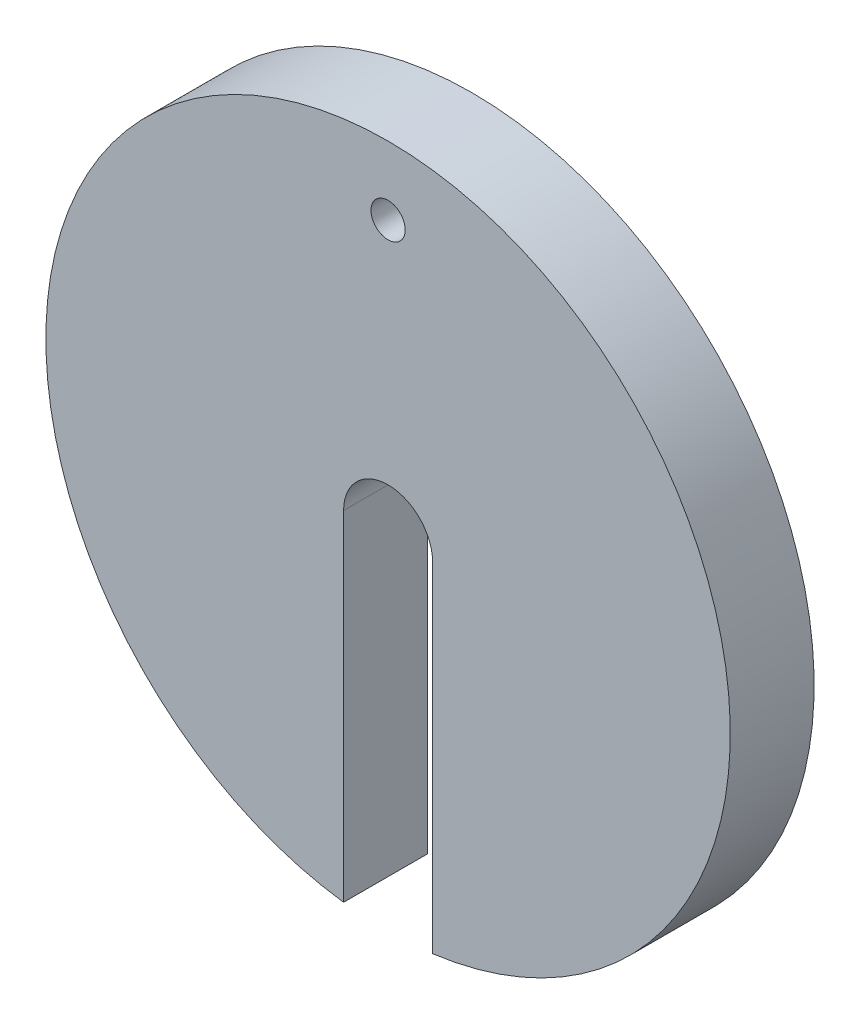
from build123d import *

# Parameters (mm, degrees)
ESQUISSE1_R          = 2.5
BASE_EXTRUSION_DEPTH = 12.25


with BuildPart() as part:
    # Esquisse1 → Base-Extrusion (new body)
    with BuildSketch(Plane.XY):
        with BuildLine():
            Line((-6.5, 0), (-6.5, -49.575699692))
            ThreePointArc((-6.5, -49.575699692), (0, 50), (6.5, -49.575699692))
            Line((6.5, -49.575699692), (6.5, 0))
            ThreePointArc((6.5, 0), (0, 6.5), (-6.5, 0))
        make_face()
        with Locations((0, 40)):
            Circle(ESQUISSE1_R, mode=Mode.SUBTRACT)
    extrude(amount=BASE_EXTRUSION_DEPTH)


solid = part.part
